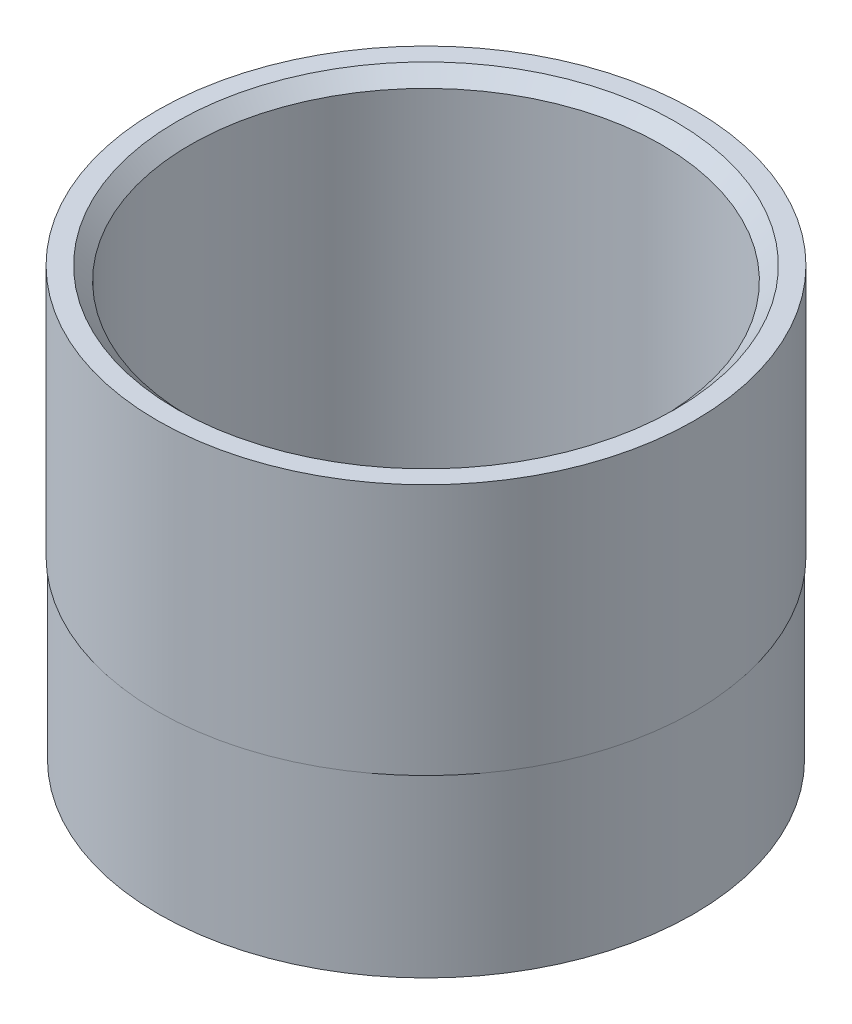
from build123d import *

# Parameters (mm, degrees)
BOSS_EXTRUDE1_START = -47.625
SKETCH2_R           = 50.8
SKETCH2_R_2         = 50.6095
BOSS_EXTRUDE1_DEPTH = 47.625


with BuildPart() as part:
    # Sketch1 → Revolve1 (revolve)
    with BuildSketch(Plane.XY, mode=Mode.PRIVATE) as revolve1_sk:
        Polygon((-44.577, 2.54), (-44.577, 78.359), (-47.117, 80.899), (-50.6095, 80.899), (-50.6095, 33.274), (-50.6095, 0), (-47.117, 0), align=None)
        Polygon((-44.577, 2.54), (-47.117, 0), (-50.6095, 0), (-50.6095, 80.899), (-47.117, 80.899), (-44.577, 78.359), align=None)
    revolve(revolve1_sk.sketch.rotate(Axis((0, 0, 0), (0, 1, 0)), 270), axis=Axis((0, 0, 0), (0, 1, 0)))

    # Sketch2 → Boss-Extrude1 (add)
    with BuildSketch(Plane(origin=(0, 80.899, 0), x_dir=(1, 0, 0), z_dir=(0, 1, 0)).offset(BOSS_EXTRUDE1_START)):
        with Locations(Location((0, 0, 0), (0, 0, 270))):
            Circle(SKETCH2_R)
        with Locations(Location((0, 0, 0), (0, 0, 90))):
            Circle(SKETCH2_R_2, mode=Mode.SUBTRACT)
    extrude(amount=BOSS_EXTRUDE1_DEPTH)


solid = part.part
